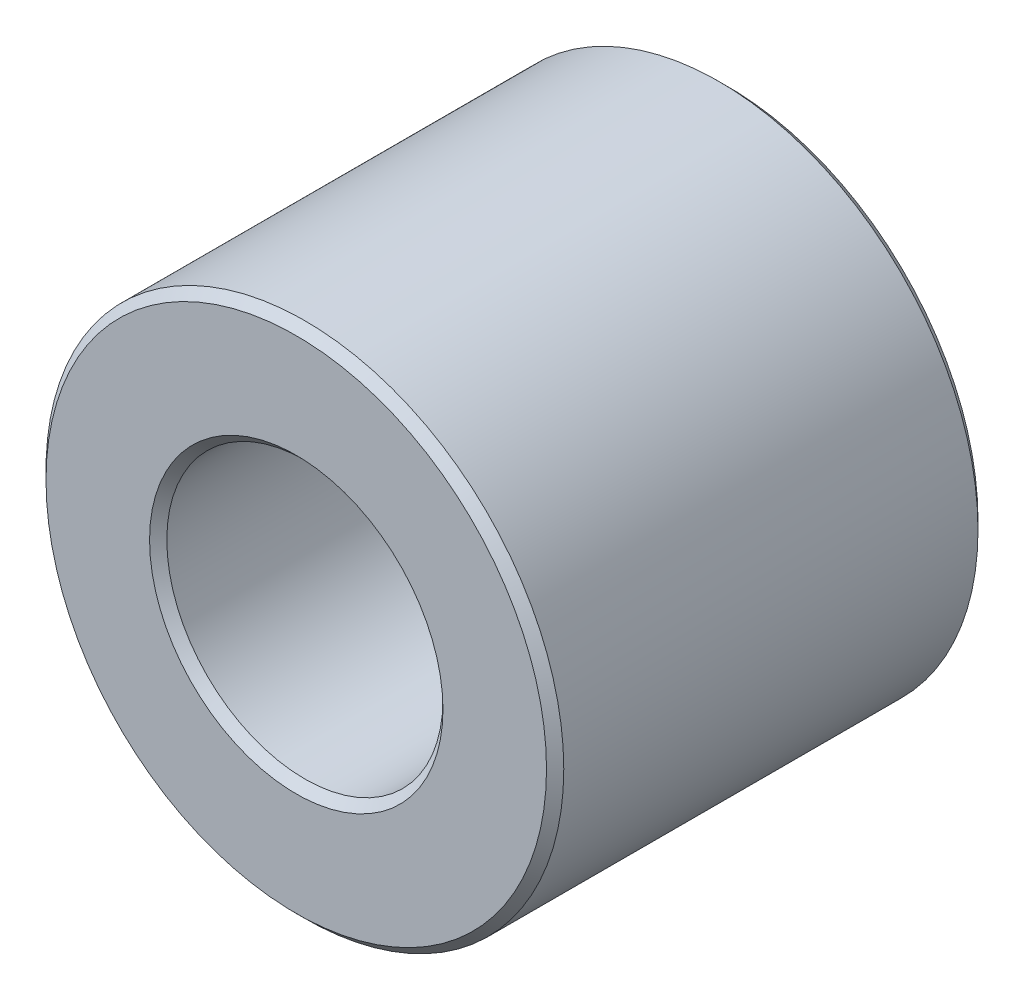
ISO-10303-21;
HEADER;
FILE_DESCRIPTION(('STEP AP214'),'2;1');
FILE_NAME('part.step','',(''),(''),'','','');
FILE_SCHEMA(('AUTOMOTIVE_DESIGN { 1 0 10303 214 1 1 1 1 }'));
ENDSEC;
DATA;
#1=APPLICATION_CONTEXT('core data for automotive mechanical design processes');
#2=APPLICATION_PROTOCOL_DEFINITION('international standard','automotive_design',2000,#1);
#3=PRODUCT_CONTEXT('',#1,'mechanical');
#4=PRODUCT('Part','Part','',(#3));
#5=PRODUCT_RELATED_PRODUCT_CATEGORY('part','',(#4));
#6=PRODUCT_DEFINITION_FORMATION('','',#4);
#7=PRODUCT_DEFINITION_CONTEXT('part definition',#1,'design');
#8=PRODUCT_DEFINITION('design','',#6,#7);
#9=PRODUCT_DEFINITION_SHAPE('','',#8);
#10=(LENGTH_UNIT() NAMED_UNIT(*) SI_UNIT(.MILLI.,.METRE.));
#11=(NAMED_UNIT(*) PLANE_ANGLE_UNIT() SI_UNIT($,.RADIAN.));
#12=(NAMED_UNIT(*) SI_UNIT($,.STERADIAN.) SOLID_ANGLE_UNIT());
#13=UNCERTAINTY_MEASURE_WITH_UNIT(LENGTH_MEASURE(1.E-05),#10,'distance_accuracy_value','');
#14=(GEOMETRIC_REPRESENTATION_CONTEXT(3) GLOBAL_UNCERTAINTY_ASSIGNED_CONTEXT((#13)) GLOBAL_UNIT_ASSIGNED_CONTEXT((#10,
#11,#12)) REPRESENTATION_CONTEXT('',''));
#15=CARTESIAN_POINT('',(0.,0.,0.));
#16=DIRECTION('',(0.,0.,1.));
#17=DIRECTION('',(1.,0.,0.));
#18=AXIS2_PLACEMENT_3D('',#15,#16,#17);
#19=CARTESIAN_POINT('',(0.,0.,2.5));
#20=DIRECTION('',(0.,0.,1.));
#21=DIRECTION('',(1.,0.,0.));
#22=AXIS2_PLACEMENT_3D('',#19,#20,#21);
#23=PLANE('',#22);
#24=CARTESIAN_POINT('',(0.,0.,2.5));
#25=DIRECTION('',(0.,0.,1.));
#26=DIRECTION('',(1.,0.,0.));
#27=AXIS2_PLACEMENT_3D('',#24,#25,#26);
#28=CIRCLE('',#27,1.7);
#29=CARTESIAN_POINT('',(1.7,0.,2.5));
#30=VERTEX_POINT('',#29);
#31=EDGE_CURVE('E10',#30,#30,#28,.F.);
#32=ORIENTED_EDGE('',*,*,#31,.T.);
#33=EDGE_LOOP('',(#32));
#34=FACE_BOUND('',#33,.T.);
#35=CARTESIAN_POINT('',(0.,0.,2.5));
#36=DIRECTION('',(0.,0.,1.));
#37=DIRECTION('',(1.,0.,0.));
#38=AXIS2_PLACEMENT_3D('',#35,#36,#37);
#39=CIRCLE('',#38,2.9);
#40=CARTESIAN_POINT('',(2.9,0.,2.5));
#41=VERTEX_POINT('',#40);
#42=EDGE_CURVE('E45',#41,#41,#39,.T.);
#43=ORIENTED_EDGE('',*,*,#42,.T.);
#44=EDGE_LOOP('',(#43));
#45=FACE_BOUND('',#44,.T.);
#46=ADVANCED_FACE('F37',(#34,#45),#23,.T.);
#47=CARTESIAN_POINT('',(0.,0.,-2.5));
#48=DIRECTION('',(0.,0.,1.));
#49=DIRECTION('',(1.,0.,0.));
#50=AXIS2_PLACEMENT_3D('',#47,#48,#49);
#51=PLANE('',#50);
#52=CARTESIAN_POINT('',(0.,0.,-2.5));
#53=DIRECTION('',(0.,0.,1.));
#54=DIRECTION('',(1.,0.,0.));
#55=AXIS2_PLACEMENT_3D('',#52,#53,#54);
#56=CIRCLE('',#55,2.9);
#57=CARTESIAN_POINT('',(2.9,0.,-2.5));
#58=VERTEX_POINT('',#57);
#59=EDGE_CURVE('E63',#58,#58,#56,.F.);
#60=ORIENTED_EDGE('',*,*,#59,.T.);
#61=EDGE_LOOP('',(#60));
#62=FACE_BOUND('',#61,.T.);
#63=CARTESIAN_POINT('',(0.,0.,-2.5));
#64=DIRECTION('',(0.,0.,1.));
#65=DIRECTION('',(1.,0.,0.));
#66=AXIS2_PLACEMENT_3D('',#63,#64,#65);
#67=CIRCLE('',#66,1.7);
#68=CARTESIAN_POINT('',(1.7,0.,-2.5));
#69=VERTEX_POINT('',#68);
#70=EDGE_CURVE('E67',#69,#69,#67,.T.);
#71=ORIENTED_EDGE('',*,*,#70,.T.);
#72=EDGE_LOOP('',(#71));
#73=FACE_BOUND('',#72,.T.);
#74=ADVANCED_FACE('F89',(#62,#73),#51,.F.);
#75=CARTESIAN_POINT('',(0.,0.,2.5));
#76=DIRECTION('',(0.,0.,-1.));
#77=DIRECTION('',(-1.,0.,0.));
#78=AXIS2_PLACEMENT_3D('',#75,#76,#77);
#79=CYLINDRICAL_SURFACE('',#78,3.);
#80=CARTESIAN_POINT('',(0.,0.,-2.4));
#81=DIRECTION('',(0.,0.,1.));
#82=DIRECTION('',(1.,0.,0.));
#83=AXIS2_PLACEMENT_3D('',#80,#81,#82);
#84=CIRCLE('',#83,3.);
#85=CARTESIAN_POINT('',(3.,0.,-2.4));
#86=VERTEX_POINT('',#85);
#87=EDGE_CURVE('E70',#86,#86,#84,.T.);
#88=ORIENTED_EDGE('',*,*,#87,.T.);
#89=EDGE_LOOP('',(#88));
#90=FACE_BOUND('',#89,.T.);
#91=CARTESIAN_POINT('',(0.,0.,2.4));
#92=DIRECTION('',(0.,0.,1.));
#93=DIRECTION('',(1.,0.,0.));
#94=AXIS2_PLACEMENT_3D('',#91,#92,#93);
#95=CIRCLE('',#94,3.);
#96=CARTESIAN_POINT('',(3.,0.,2.4));
#97=VERTEX_POINT('',#96);
#98=EDGE_CURVE('E74',#97,#97,#95,.F.);
#99=ORIENTED_EDGE('',*,*,#98,.T.);
#100=EDGE_LOOP('',(#99));
#101=FACE_BOUND('',#100,.T.);
#102=ADVANCED_FACE('F78',(#90,#101),#79,.T.);
#103=CARTESIAN_POINT('',(0.,0.,2.5));
#104=DIRECTION('',(0.,0.,-1.));
#105=DIRECTION('',(-1.,0.,0.));
#106=AXIS2_PLACEMENT_3D('',#103,#104,#105);
#107=CYLINDRICAL_SURFACE('',#106,1.6);
#108=CARTESIAN_POINT('',(0.,0.,-2.4));
#109=DIRECTION('',(0.,0.,1.));
#110=DIRECTION('',(1.,0.,0.));
#111=AXIS2_PLACEMENT_3D('',#108,#109,#110);
#112=CIRCLE('',#111,1.6);
#113=CARTESIAN_POINT('',(1.6,0.,-2.4));
#114=VERTEX_POINT('',#113);
#115=EDGE_CURVE('E51',#114,#114,#112,.F.);
#116=ORIENTED_EDGE('',*,*,#115,.T.);
#117=EDGE_LOOP('',(#116));
#118=FACE_BOUND('',#117,.T.);
#119=CARTESIAN_POINT('',(0.,0.,2.4));
#120=DIRECTION('',(0.,0.,1.));
#121=DIRECTION('',(1.,0.,0.));
#122=AXIS2_PLACEMENT_3D('',#119,#120,#121);
#123=CIRCLE('',#122,1.6);
#124=CARTESIAN_POINT('',(1.6,0.,2.4));
#125=VERTEX_POINT('',#124);
#126=EDGE_CURVE('E57',#125,#125,#123,.T.);
#127=ORIENTED_EDGE('',*,*,#126,.T.);
#128=EDGE_LOOP('',(#127));
#129=FACE_BOUND('',#128,.T.);
#130=ADVANCED_FACE('F97',(#118,#129),#107,.F.);
#131=CARTESIAN_POINT('',(0.,0.,-2.4));
#132=DIRECTION('',(0.,0.,1.));
#133=DIRECTION('',(1.,0.,0.));
#134=AXIS2_PLACEMENT_3D('',#131,#132,#133);
#135=CONICAL_SURFACE('',#134,3.,0.785398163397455);
#136=ORIENTED_EDGE('',*,*,#59,.F.);
#137=EDGE_LOOP('',(#136));
#138=FACE_BOUND('',#137,.T.);
#139=ORIENTED_EDGE('',*,*,#87,.F.);
#140=EDGE_LOOP('',(#139));
#141=FACE_BOUND('',#140,.T.);
#142=ADVANCED_FACE('F102',(#138,#141),#135,.T.);
#143=CARTESIAN_POINT('',(0.,0.,-2.5));
#144=DIRECTION('',(0.,0.,-1.));
#145=DIRECTION('',(-1.,0.,0.));
#146=AXIS2_PLACEMENT_3D('',#143,#144,#145);
#147=CONICAL_SURFACE('',#146,1.7,0.785398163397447);
#148=ORIENTED_EDGE('',*,*,#115,.F.);
#149=EDGE_LOOP('',(#148));
#150=FACE_BOUND('',#149,.T.);
#151=ORIENTED_EDGE('',*,*,#70,.F.);
#152=EDGE_LOOP('',(#151));
#153=FACE_BOUND('',#152,.T.);
#154=ADVANCED_FACE('F86',(#150,#153),#147,.F.);
#155=CARTESIAN_POINT('',(0.,0.,2.4));
#156=DIRECTION('',(0.,0.,1.));
#157=DIRECTION('',(1.,0.,0.));
#158=AXIS2_PLACEMENT_3D('',#155,#156,#157);
#159=CONICAL_SURFACE('',#158,1.6,0.785398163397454);
#160=ORIENTED_EDGE('',*,*,#31,.F.);
#161=EDGE_LOOP('',(#160));
#162=FACE_BOUND('',#161,.T.);
#163=ORIENTED_EDGE('',*,*,#126,.F.);
#164=EDGE_LOOP('',(#163));
#165=FACE_BOUND('',#164,.T.);
#166=ADVANCED_FACE('F82',(#162,#165),#159,.F.);
#167=CARTESIAN_POINT('',(0.,0.,2.5));
#168=DIRECTION('',(0.,0.,-1.));
#169=DIRECTION('',(-1.,0.,0.));
#170=AXIS2_PLACEMENT_3D('',#167,#168,#169);
#171=CONICAL_SURFACE('',#170,2.9,0.785398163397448);
#172=ORIENTED_EDGE('',*,*,#98,.F.);
#173=EDGE_LOOP('',(#172));
#174=FACE_BOUND('',#173,.T.);
#175=ORIENTED_EDGE('',*,*,#42,.F.);
#176=EDGE_LOOP('',(#175));
#177=FACE_BOUND('',#176,.T.);
#178=ADVANCED_FACE('F39',(#174,#177),#171,.T.);
#179=CLOSED_SHELL('',(#46,#74,#102,#130,#142,#154,#166,#178));
#180=MANIFOLD_SOLID_BREP('B2',#179);
#181=ADVANCED_BREP_SHAPE_REPRESENTATION('',(#18,#180),#14);
#182=SHAPE_DEFINITION_REPRESENTATION(#9,#181);
ENDSEC;
END-ISO-10303-21;
